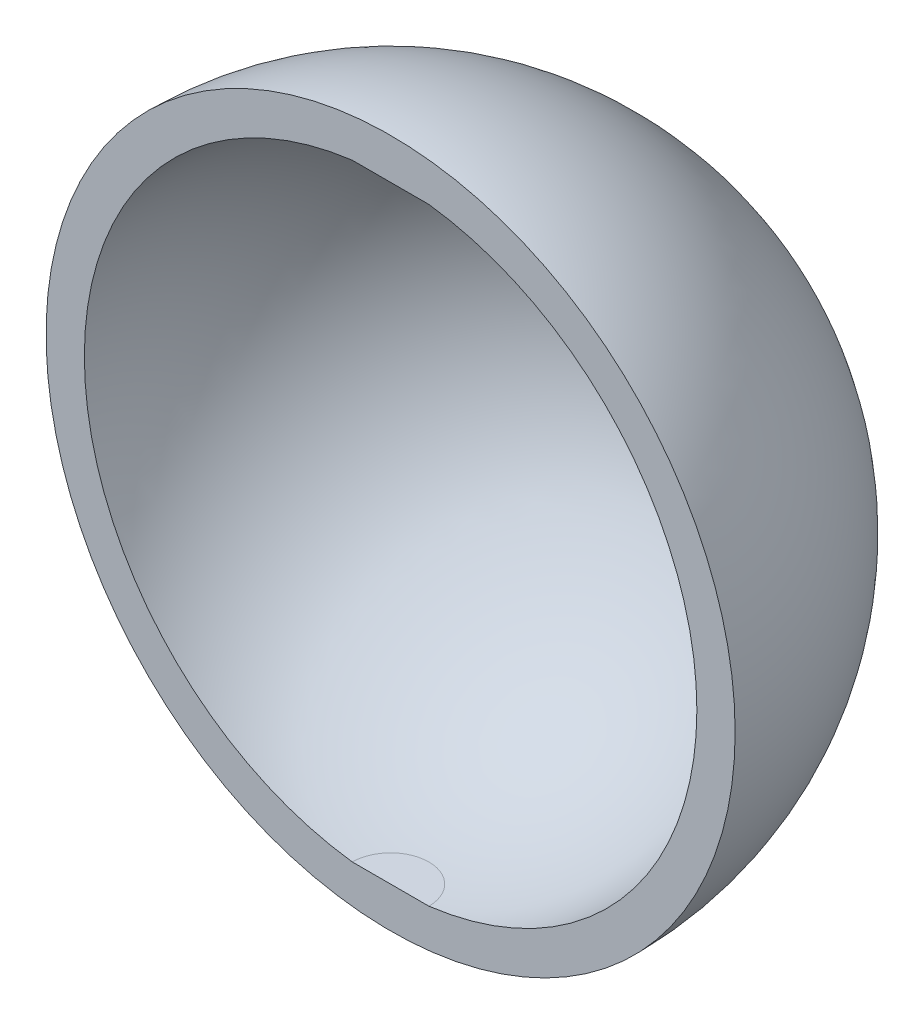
ISO-10303-21;
HEADER;
FILE_DESCRIPTION(('STEP AP214'),'2;1');
FILE_NAME('part.step','',(''),(''),'','','');
FILE_SCHEMA(('AUTOMOTIVE_DESIGN { 1 0 10303 214 1 1 1 1 }'));
ENDSEC;
DATA;
#1=APPLICATION_CONTEXT('core data for automotive mechanical design processes');
#2=APPLICATION_PROTOCOL_DEFINITION('international standard','automotive_design',2000,#1);
#3=PRODUCT_CONTEXT('',#1,'mechanical');
#4=PRODUCT('Part','Part','',(#3));
#5=PRODUCT_RELATED_PRODUCT_CATEGORY('part','',(#4));
#6=PRODUCT_DEFINITION_FORMATION('','',#4);
#7=PRODUCT_DEFINITION_CONTEXT('part definition',#1,'design');
#8=PRODUCT_DEFINITION('design','',#6,#7);
#9=PRODUCT_DEFINITION_SHAPE('','',#8);
#10=(LENGTH_UNIT() NAMED_UNIT(*) SI_UNIT(.MILLI.,.METRE.));
#11=(NAMED_UNIT(*) PLANE_ANGLE_UNIT() SI_UNIT($,.RADIAN.));
#12=(NAMED_UNIT(*) SI_UNIT($,.STERADIAN.) SOLID_ANGLE_UNIT());
#13=UNCERTAINTY_MEASURE_WITH_UNIT(LENGTH_MEASURE(1.E-05),#10,'distance_accuracy_value','');
#14=(GEOMETRIC_REPRESENTATION_CONTEXT(3) GLOBAL_UNCERTAINTY_ASSIGNED_CONTEXT((#13)) GLOBAL_UNIT_ASSIGNED_CONTEXT((#10,
#11,#12)) REPRESENTATION_CONTEXT('',''));
#15=CARTESIAN_POINT('',(0.,0.,0.));
#16=DIRECTION('',(0.,0.,1.));
#17=DIRECTION('',(1.,0.,0.));
#18=AXIS2_PLACEMENT_3D('',#15,#16,#17);
#19=CARTESIAN_POINT('',(0.,28.575,0.));
#20=DIRECTION('',(0.,-1.,0.));
#21=DIRECTION('',(-1.,0.,0.));
#22=AXIS2_PLACEMENT_3D('',#19,#20,#21);
#23=SPHERICAL_SURFACE('',#22,28.575);
#24=CARTESIAN_POINT('',(0.,28.575,0.));
#25=DIRECTION('',(0.,0.,-1.));
#26=DIRECTION('',(1.,0.,0.));
#27=AXIS2_PLACEMENT_3D('',#24,#25,#26);
#28=SPHERICAL_SURFACE('',#27,28.575);
#29=CARTESIAN_POINT('',(0.,28.575,0.));
#30=DIRECTION('',(0.,0.,-1.));
#31=DIRECTION('',(1.,0.,0.));
#32=AXIS2_PLACEMENT_3D('',#29,#30,#31);
#33=CIRCLE('',#32,28.575);
#34=CARTESIAN_POINT('',(28.575,28.575,-1.99538158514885E-13));
#35=VERTEX_POINT('',#34);
#36=EDGE_CURVE('E66',#35,#35,#33,.T.);
#37=ORIENTED_EDGE('',*,*,#36,.T.);
#38=EDGE_LOOP('',(#37));
#39=FACE_BOUND('',#38,.T.);
#40=ADVANCED_FACE('F32',(#39),#28,.T.);
#41=CARTESIAN_POINT('',(-3.175,3.37421876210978,0.));
#42=DIRECTION('',(0.,1.,0.));
#43=DIRECTION('',(0.,0.,1.));
#44=AXIS2_PLACEMENT_3D('',#41,#42,#43);
#45=PLANE('',#44);
#46=CARTESIAN_POINT('',(0.,3.37421876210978,0.));
#47=DIRECTION('',(0.,-1.,0.));
#48=DIRECTION('',(0.,0.,-1.));
#49=AXIS2_PLACEMENT_3D('',#46,#47,#48);
#50=CIRCLE('',#49,3.175);
#51=CARTESIAN_POINT('',(-3.175,3.37421876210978,0.));
#52=VERTEX_POINT('',#51);
#53=CARTESIAN_POINT('',(3.175,3.37421876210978,0.));
#54=VERTEX_POINT('',#53);
#55=EDGE_CURVE('E11',#52,#54,#50,.T.);
#56=ORIENTED_EDGE('',*,*,#55,.F.);
#57=DIRECTION('',(1.,0.,0.));
#58=VECTOR('',#57,1.);
#59=CARTESIAN_POINT('',(-3.175,3.37421876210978,0.));
#60=LINE('',#59,#58);
#61=EDGE_CURVE('E69',#52,#54,#60,.T.);
#62=ORIENTED_EDGE('',*,*,#61,.T.);
#63=EDGE_LOOP('',(#56,#62));
#64=FACE_BOUND('',#63,.T.);
#65=ADVANCED_FACE('F34',(#64),#45,.T.);
#66=CARTESIAN_POINT('',(0.,28.575,0.));
#67=DIRECTION('',(0.,-1.,0.));
#68=DIRECTION('',(-1.,0.,0.));
#69=AXIS2_PLACEMENT_3D('',#66,#67,#68);
#70=SPHERICAL_SURFACE('',#69,25.4);
#71=CARTESIAN_POINT('',(0.,53.7757812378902,0.));
#72=DIRECTION('',(0.,-1.,0.));
#73=DIRECTION('',(0.,0.,-1.));
#74=AXIS2_PLACEMENT_3D('',#71,#72,#73);
#75=CIRCLE('',#74,3.175);
#76=CARTESIAN_POINT('',(-3.175,53.7757812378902,0.));
#77=VERTEX_POINT('',#76);
#78=CARTESIAN_POINT('',(3.175,53.7757812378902,0.));
#79=VERTEX_POINT('',#78);
#80=EDGE_CURVE('E40',#77,#79,#75,.T.);
#81=ORIENTED_EDGE('',*,*,#80,.F.);
#82=CARTESIAN_POINT('',(0.,28.575,0.));
#83=DIRECTION('',(0.,0.,1.));
#84=DIRECTION('',(1.,0.,0.));
#85=AXIS2_PLACEMENT_3D('',#82,#83,#84);
#86=CIRCLE('',#85,25.4);
#87=EDGE_CURVE('E64',#77,#52,#86,.T.);
#88=ORIENTED_EDGE('',*,*,#87,.T.);
#89=ORIENTED_EDGE('',*,*,#55,.T.);
#90=CARTESIAN_POINT('',(0.,28.575,0.));
#91=DIRECTION('',(0.,0.,-1.));
#92=DIRECTION('',(-1.,0.,0.));
#93=AXIS2_PLACEMENT_3D('',#90,#91,#92);
#94=CIRCLE('',#93,25.4);
#95=EDGE_CURVE('E63',#79,#54,#94,.T.);
#96=ORIENTED_EDGE('',*,*,#95,.F.);
#97=EDGE_LOOP('',(#81,#88,#89,#96));
#98=FACE_BOUND('',#97,.T.);
#99=ADVANCED_FACE('F70',(#98),#70,.F.);
#100=CARTESIAN_POINT('',(-3.175,53.7757812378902,0.));
#101=DIRECTION('',(0.,-1.,0.));
#102=DIRECTION('',(0.,0.,-1.));
#103=AXIS2_PLACEMENT_3D('',#100,#101,#102);
#104=PLANE('',#103);
#105=ORIENTED_EDGE('',*,*,#80,.T.);
#106=DIRECTION('',(-1.,0.,0.));
#107=VECTOR('',#106,1.);
#108=CARTESIAN_POINT('',(-3.175,53.7757812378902,0.));
#109=LINE('',#108,#107);
#110=EDGE_CURVE('E59',#79,#77,#109,.T.);
#111=ORIENTED_EDGE('',*,*,#110,.T.);
#112=EDGE_LOOP('',(#105,#111));
#113=FACE_BOUND('',#112,.T.);
#114=ADVANCED_FACE('F68',(#113),#104,.T.);
#115=CARTESIAN_POINT('',(0.,28.575,0.));
#116=DIRECTION('',(0.,0.,1.));
#117=DIRECTION('',(1.,0.,0.));
#118=AXIS2_PLACEMENT_3D('',#115,#116,#117);
#119=PLANE('',#118);
#120=ORIENTED_EDGE('',*,*,#110,.F.);
#121=ORIENTED_EDGE('',*,*,#95,.T.);
#122=ORIENTED_EDGE('',*,*,#61,.F.);
#123=ORIENTED_EDGE('',*,*,#87,.F.);
#124=EDGE_LOOP('',(#120,#121,#122,#123));
#125=FACE_BOUND('',#124,.T.);
#126=ORIENTED_EDGE('',*,*,#36,.F.);
#127=EDGE_LOOP('',(#126));
#128=FACE_BOUND('',#127,.T.);
#129=ADVANCED_FACE('F60',(#125,#128),#119,.T.);
#130=CLOSED_SHELL('',(#40,#65,#99,#114,#129));
#131=MANIFOLD_SOLID_BREP('B2',#130);
#132=ADVANCED_BREP_SHAPE_REPRESENTATION('',(#18,#131),#14);
#133=SHAPE_DEFINITION_REPRESENTATION(#9,#132);
ENDSEC;
END-ISO-10303-21;
